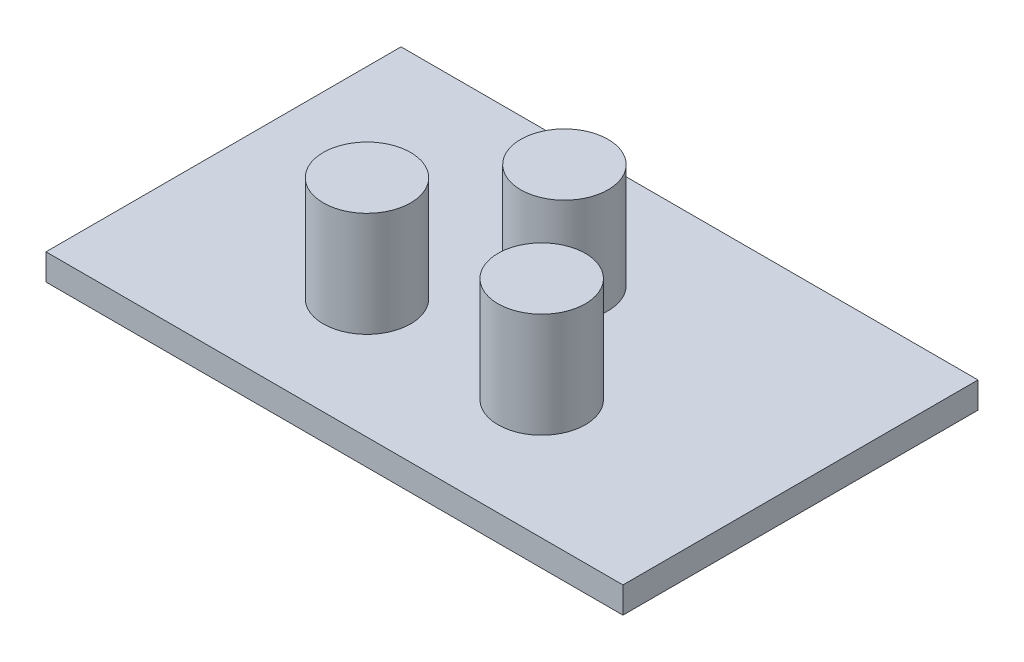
from build123d import *

# Parameters (mm, degrees)
SKETCH1_W           = 33.02
SKETCH1_H           = 20.32
BOSS_EXTRUDE1_DEPTH = 1.5
SKETCH2_R           = 2.5
BOSS_EXTRUDE2_DEPTH = 6


with BuildPart() as part:
    # Sketch1 → Boss-Extrude1 (new body)
    with BuildSketch(Plane(origin=(0, 0, 0), x_dir=(1, 0, 0), z_dir=(0, 1, 0))):
        Rectangle(SKETCH1_W, SKETCH1_H)
    extrude(amount=BOSS_EXTRUDE1_DEPTH)

    # Sketch2 → Boss-Extrude2 (add)
    with BuildSketch(Plane(origin=(0, 1.5, 0), x_dir=(1, 0, 0), z_dir=(0, 1, 0))):
        with Locations(Location((0, 3, 0), (0, 0, 270))):
            Circle(SKETCH2_R)
        with Locations(Location((-5, -3.3, 0), (0, 0, 270))):
            Circle(SKETCH2_R)
        with Locations(Location((5, -3.3, 0), (0, 0, 270))):
            Circle(SKETCH2_R)
    extrude(amount=BOSS_EXTRUDE2_DEPTH)


solid = part.part
